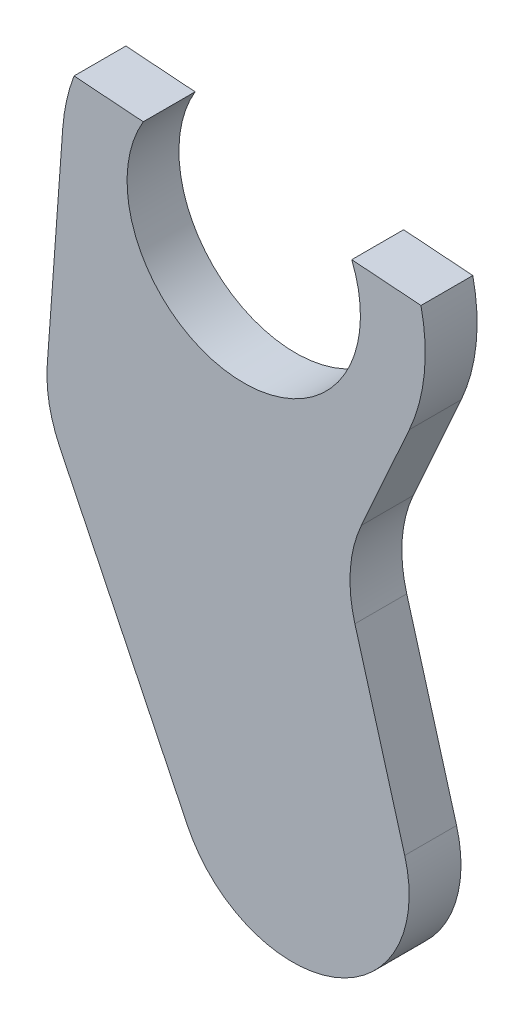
from build123d import *

# Parameters (mm, degrees)
EXTRUDE_1_DEPTH = 2


with BuildPart() as part:
    # Sketch 1 → Extrude 1 (new body)
    with BuildSketch(Plane.XY):
        with BuildLine():
            Line((6.835883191, 1.5068843), (4.165896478, 1.701560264))
            ThreePointArc((4.165896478, 1.701560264), (3.73543984, -2.509280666), (0, -4.5))
            ThreePointArc((0, -4.5), (-3.908024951, -2.230995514), (-3.87501606, 2.287848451))
            Line((-3.87501606, 2.287848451), (-6.545003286, 2.482525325))
            ThreePointArc((-6.545003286, 2.482525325), (-6.834837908, 1.511618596), (-6.981466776, 0.509039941))
            Line((-6.981466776, 0.509039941), (-7.577076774, -7.659732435))
            ThreePointArc((-7.577076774, -7.659732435), (-7.501263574, -8.962790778), (-7.09077733, -10.201826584))
            Line((-7.09077733, -10.201826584), (-2.171339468, -20.364693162))
            ThreePointArc((-2.171339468, -20.364693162), (3.479243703, -22.609933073), (6.208420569, -17.176537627))
            Line((6.208420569, -17.176537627), (4.28717341, -10.400434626))
            ThreePointArc((4.28717341, -10.400434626), (4.110793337, -8.672933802), (4.53589037, -6.98928849))
            Line((4.53589037, -6.98928849), (6.386330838, -2.866143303))
            ThreePointArc((6.386330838, -2.866143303), (6.963302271, -0.715835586), (6.835883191, 1.5068843))
        make_face()
    extrude(amount=EXTRUDE_1_DEPTH)


solid = part.part
